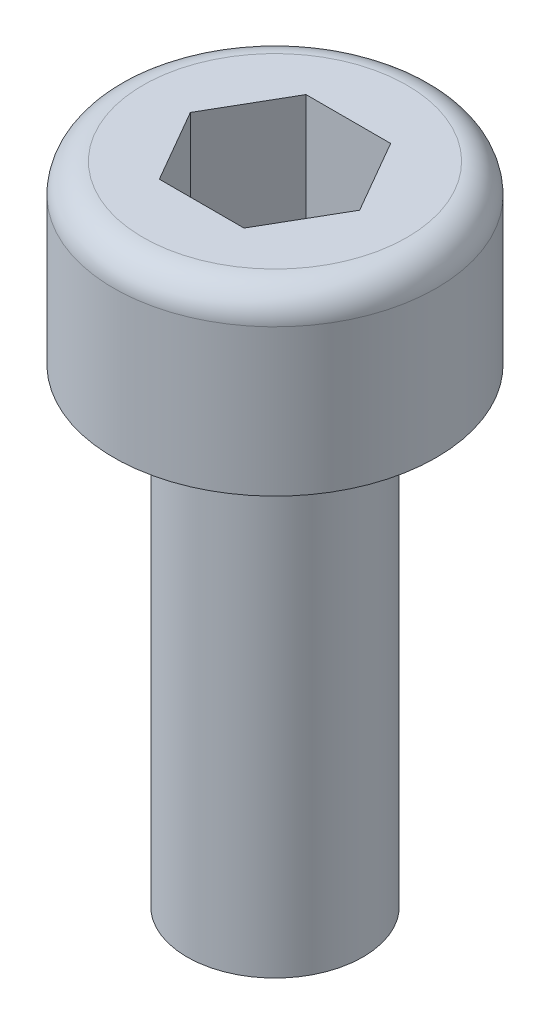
from build123d import *

# Parameters (mm, degrees)
CUT_EXTRUDE1_DEPTH = 2


with BuildPart() as part:
    # Sketch1 → Base-Revolve (revolve)
    with BuildSketch(Plane.XY):
        with BuildLine():
            Line((0, -8.401923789), (0, 3))
            Line((0, 3), (2.25, 3))
            ThreePointArc((2.25, 3), (2.603553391, 2.853553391), (2.75, 2.5))
            Line((2.75, 2.5), (2.75, 0))
            Line((2.75, 0), (1.5, 0))
            Line((1.5, 0), (1.5, -8))
            Line((1.5, -8), (0, -8.401923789))
        make_face()
    revolve(axis=Axis((0, 3, 0), (0, 1, 0)))

    # Sketch2 → Cut-Extrude1 (cut)
    with BuildSketch(Plane(origin=(0, 3, 0), x_dir=(-1, 0, 0), z_dir=(0, 1, 0))):
        Polygon((-1.443375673, 0), (-0.721687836, -1.25), (0.721687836, -1.25), (1.443375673, 0), (0.721687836, 1.25), (-0.721687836, 1.25), align=None)
    extrude(amount=-CUT_EXTRUDE1_DEPTH, mode=Mode.SUBTRACT)


solid = part.part
